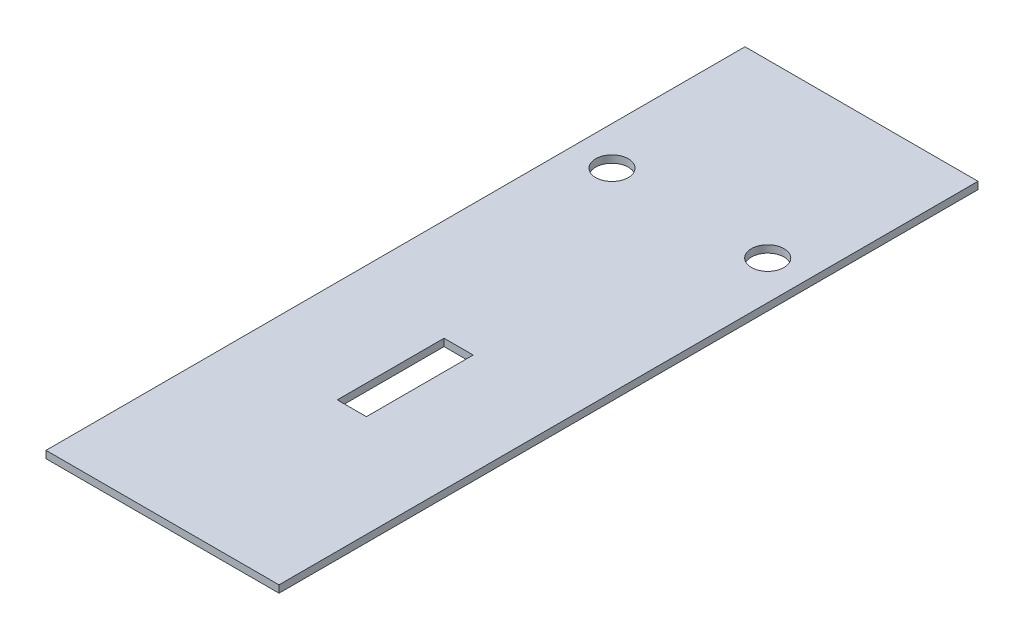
from build123d import *

# Parameters (mm, degrees)
SKETCH1_W           = 152.4
SKETCH1_H           = 457.2
BOSS_EXTRUDE1_DEPTH = 4.7625
SKETCH2_R           = 10.668
SKETCH2_W           = 19.05
SKETCH2_H           = 69.85
CUT_EXTRUDE3_DEPTH  = 242.012616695


with BuildPart() as part:
    # Sketch1 → Boss-Extrude1 (new body)
    with BuildSketch(Plane(origin=(0, 0, 0), x_dir=(1, 0, 0), z_dir=(0, 1, 0))):
        Rectangle(SKETCH1_W, SKETCH1_H)
    extrude(amount=BOSS_EXTRUDE1_DEPTH)

    # Sketch2 → Cut-Extrude3 (cut, through all)
    with BuildSketch(Plane(origin=(0, 0, 0), x_dir=(1, 0, 0), z_dir=(0, 1, 0))):
        with Locations(Location((-50.927, 116.332, 0), (0, 0, 90))):
            Circle(SKETCH2_R)
        with Locations(Location((50.927, 116.332, 0), (0, 0, 90))):
            Circle(SKETCH2_R)
        with Locations((0, -69.85)):
            Rectangle(SKETCH2_W, SKETCH2_H)
    extrude(amount=CUT_EXTRUDE3_DEPTH, mode=Mode.SUBTRACT)


solid = part.part
